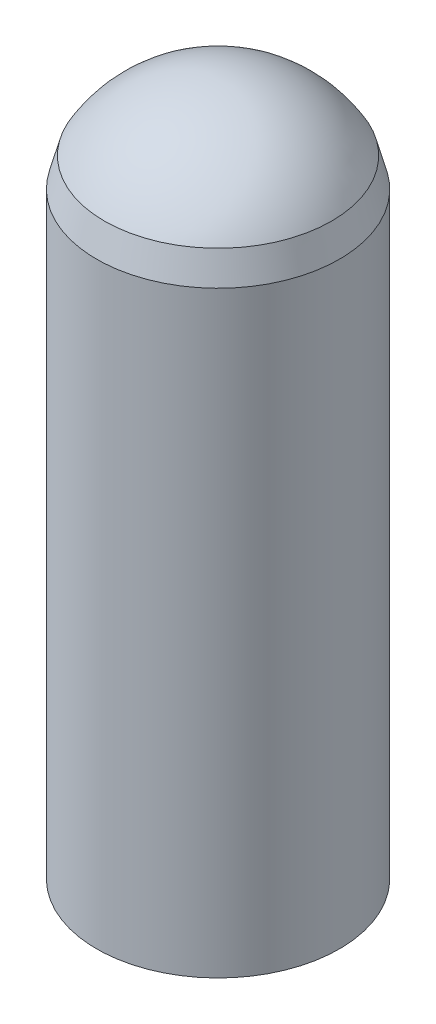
ISO-10303-21;
HEADER;
FILE_DESCRIPTION(('STEP AP214'),'2;1');
FILE_NAME('part.step','',(''),(''),'','','');
FILE_SCHEMA(('AUTOMOTIVE_DESIGN { 1 0 10303 214 1 1 1 1 }'));
ENDSEC;
DATA;
#1=APPLICATION_CONTEXT('core data for automotive mechanical design processes');
#2=APPLICATION_PROTOCOL_DEFINITION('international standard','automotive_design',2000,#1);
#3=PRODUCT_CONTEXT('',#1,'mechanical');
#4=PRODUCT('Part','Part','',(#3));
#5=PRODUCT_RELATED_PRODUCT_CATEGORY('part','',(#4));
#6=PRODUCT_DEFINITION_FORMATION('','',#4);
#7=PRODUCT_DEFINITION_CONTEXT('part definition',#1,'design');
#8=PRODUCT_DEFINITION('design','',#6,#7);
#9=PRODUCT_DEFINITION_SHAPE('','',#8);
#10=(LENGTH_UNIT() NAMED_UNIT(*) SI_UNIT(.MILLI.,.METRE.));
#11=(NAMED_UNIT(*) PLANE_ANGLE_UNIT() SI_UNIT($,.RADIAN.));
#12=(NAMED_UNIT(*) SI_UNIT($,.STERADIAN.) SOLID_ANGLE_UNIT());
#13=UNCERTAINTY_MEASURE_WITH_UNIT(LENGTH_MEASURE(1.E-05),#10,'distance_accuracy_value','');
#14=(GEOMETRIC_REPRESENTATION_CONTEXT(3) GLOBAL_UNCERTAINTY_ASSIGNED_CONTEXT((#13)) GLOBAL_UNIT_ASSIGNED_CONTEXT((#10,
#11,#12)) REPRESENTATION_CONTEXT('',''));
#15=CARTESIAN_POINT('',(0.,0.,0.));
#16=DIRECTION('',(0.,0.,1.));
#17=DIRECTION('',(1.,0.,0.));
#18=AXIS2_PLACEMENT_3D('',#15,#16,#17);
#19=CARTESIAN_POINT('',(0.,0.,0.));
#20=DIRECTION('',(0.,-1.,0.));
#21=DIRECTION('',(0.,0.,-1.));
#22=AXIS2_PLACEMENT_3D('',#19,#20,#21);
#23=PLANE('',#22);
#24=CARTESIAN_POINT('',(0.,0.,0.));
#25=DIRECTION('',(0.,-1.,0.));
#26=DIRECTION('',(0.,0.,-1.));
#27=AXIS2_PLACEMENT_3D('',#24,#25,#26);
#28=CIRCLE('',#27,0.0999999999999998);
#29=CARTESIAN_POINT('',(0.,0.,-0.0999999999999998));
#30=VERTEX_POINT('',#29);
#31=EDGE_CURVE('E10',#30,#30,#28,.T.);
#32=ORIENTED_EDGE('',*,*,#31,.T.);
#33=EDGE_LOOP('',(#32));
#34=FACE_BOUND('',#33,.T.);
#35=ADVANCED_FACE('F31',(#34),#23,.T.);
#36=CARTESIAN_POINT('',(0.,1.5,0.));
#37=DIRECTION('',(0.,-1.,0.));
#38=DIRECTION('',(0.,0.,-1.));
#39=AXIS2_PLACEMENT_3D('',#36,#37,#38);
#40=DEGENERATE_TOROIDAL_SURFACE('',#39,0.1,1.5,.T.);
#41=CARTESIAN_POINT('',(0.,0.3,0.));
#42=DIRECTION('',(0.,-1.,0.));
#43=DIRECTION('',(0.,0.,-1.));
#44=AXIS2_PLACEMENT_3D('',#41,#42,#43);
#45=CIRCLE('',#44,1.);
#46=CARTESIAN_POINT('',(0.,0.3,-1.));
#47=VERTEX_POINT('',#46);
#48=EDGE_CURVE('E37',#47,#47,#45,.T.);
#49=ORIENTED_EDGE('',*,*,#48,.T.);
#50=EDGE_LOOP('',(#49));
#51=FACE_BOUND('',#50,.T.);
#52=ORIENTED_EDGE('',*,*,#31,.F.);
#53=EDGE_LOOP('',(#52));
#54=FACE_BOUND('',#53,.T.);
#55=ADVANCED_FACE('F63',(#51,#54),#40,.T.);
#56=CARTESIAN_POINT('',(0.,0.,0.));
#57=DIRECTION('',(0.,-1.,0.));
#58=DIRECTION('',(0.,0.,-1.));
#59=AXIS2_PLACEMENT_3D('',#56,#57,#58);
#60=CYLINDRICAL_SURFACE('',#59,1.);
#61=CARTESIAN_POINT('',(0.,5.22,0.));
#62=DIRECTION('',(0.,-1.,0.));
#63=DIRECTION('',(0.,0.,-1.));
#64=AXIS2_PLACEMENT_3D('',#61,#62,#63);
#65=CIRCLE('',#64,1.);
#66=CARTESIAN_POINT('',(0.,5.22,-1.));
#67=VERTEX_POINT('',#66);
#68=EDGE_CURVE('E41',#67,#67,#65,.T.);
#69=ORIENTED_EDGE('',*,*,#68,.T.);
#70=EDGE_LOOP('',(#69));
#71=FACE_BOUND('',#70,.T.);
#72=ORIENTED_EDGE('',*,*,#48,.F.);
#73=EDGE_LOOP('',(#72));
#74=FACE_BOUND('',#73,.T.);
#75=ADVANCED_FACE('F60',(#71,#74),#60,.T.);
#76=CARTESIAN_POINT('',(0.,5.22,0.));
#77=DIRECTION('',(0.,-1.,0.));
#78=DIRECTION('',(0.,0.,-1.));
#79=AXIS2_PLACEMENT_3D('',#76,#77,#78);
#80=CONICAL_SURFACE('',#79,1.,0.26179938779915);
#81=CARTESIAN_POINT('',(0.,5.46,0.));
#82=DIRECTION('',(0.,-1.,0.));
#83=DIRECTION('',(0.,0.,-1.));
#84=AXIS2_PLACEMENT_3D('',#81,#82,#83);
#85=CIRCLE('',#84,0.93569219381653);
#86=CARTESIAN_POINT('',(0.,5.46,-0.93569219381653));
#87=VERTEX_POINT('',#86);
#88=EDGE_CURVE('E45',#87,#87,#85,.T.);
#89=ORIENTED_EDGE('',*,*,#88,.T.);
#90=EDGE_LOOP('',(#89));
#91=FACE_BOUND('',#90,.T.);
#92=ORIENTED_EDGE('',*,*,#68,.F.);
#93=EDGE_LOOP('',(#92));
#94=FACE_BOUND('',#93,.T.);
#95=ADVANCED_FACE('F51',(#91,#94),#80,.T.);
#96=CARTESIAN_POINT('',(0.,4.91933344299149,0.));
#97=DIRECTION('',(0.,-1.,0.));
#98=DIRECTION('',(1.,0.,0.));
#99=AXIS2_PLACEMENT_3D('',#96,#97,#98);
#100=SPHERICAL_SURFACE('',#99,1.08066655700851);
#101=ORIENTED_EDGE('',*,*,#88,.F.);
#102=EDGE_LOOP('',(#101));
#103=FACE_BOUND('',#102,.T.);
#104=ADVANCED_FACE('F54',(#103),#100,.T.);
#105=CLOSED_SHELL('',(#35,#55,#75,#95,#104));
#106=MANIFOLD_SOLID_BREP('B2',#105);
#107=ADVANCED_BREP_SHAPE_REPRESENTATION('',(#18,#106),#14);
#108=SHAPE_DEFINITION_REPRESENTATION(#9,#107);
ENDSEC;
END-ISO-10303-21;
